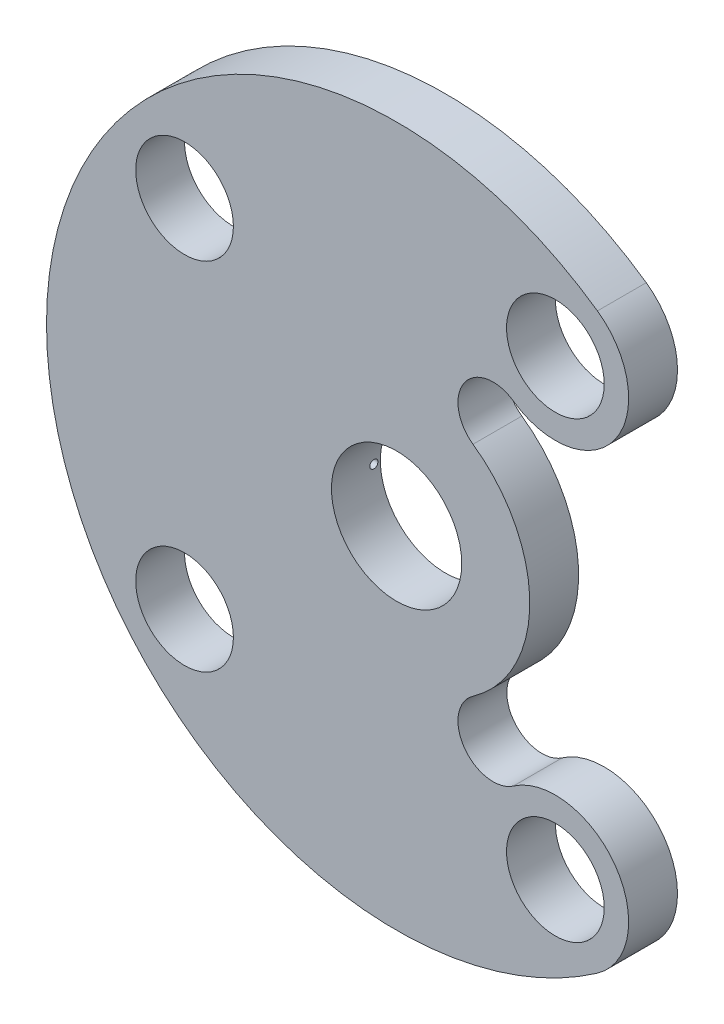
from build123d import *

# Parameters (mm, degrees)
ESQUISSE1_R             = 4
ESQUISSE1_R_2           = 3
EXTRUSION1_DEPTH        = 3
ENL_V_START             = -6.079454
ESQUISSE4_R             = 0.25
ENL_V_MAT_EXTRU_1_DEPTH = 2.087274


with BuildPart() as part:
    # Esquisse1 → Extrusion1 (new body)
    with BuildSketch(Plane.XY):
        with BuildLine():
            ThreePointArc((7.169705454, 10.239400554), (13.436983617, 11.344490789), (12.331893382, 17.611768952))
            ThreePointArc((12.331893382, 17.611768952), (-21.5, 0), (12.331893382, -17.611768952))
            ThreePointArc((12.331893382, -17.611768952), (13.436983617, -11.344490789), (7.169705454, -10.239400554))
            ThreePointArc((7.169705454, -10.239400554), (4.160561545, -9.708807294), (4.691154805, -6.699663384))
            ThreePointArc((4.691154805, -6.699663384), (8.178778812, 0), (4.691154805, 6.699663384))
            ThreePointArc((4.691154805, 6.699663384), (4.160561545, 9.708807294), (7.169705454, 10.239400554))
        make_face()
        Circle(ESQUISSE1_R, mode=Mode.SUBTRACT)
        with Locations((-13.022755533, -10.927389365)):
            Circle(ESQUISSE1_R_2, mode=Mode.SUBTRACT)
        with Locations((9.750799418, -13.925584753)):
            Circle(ESQUISSE1_R_2, mode=Mode.SUBTRACT)
        with Locations((-13.022755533, 10.927389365)):
            Circle(ESQUISSE1_R_2, mode=Mode.SUBTRACT)
        with Locations((9.750799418, 13.925584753)):
            Circle(ESQUISSE1_R_2, mode=Mode.SUBTRACT)
    extrude(amount=EXTRUSION1_DEPTH)

    # Esquisse3 → Enl_vement de mati_re-R_volution1 (revolve, cut)
    with BuildSketch(Plane(origin=(0, 0, 0), x_dir=(1, 0, 0), z_dir=(0, 1, 0))):
        Polygon((-13.90360047, 0.970440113), (-14.022755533, 0), (-6.119155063, -0.970440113), (-6, 0), align=None)
    revolve(axis=Axis((-24.2297912, 0, -2.238336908), (0.992546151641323, 0, 0.12186934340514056)), mode=Mode.SUBTRACT)

    # Esquisse4 → Enl_v. mat.-Extru.1 (cut)
    with BuildSketch(Plane(origin=(0, 0, 0), x_dir=(0, 0, -1), z_dir=(1, 0, 0)).offset(ENL_V_START)):
        with Locations((-0.397096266, 0)):
            Circle(ESQUISSE4_R)
    extrude(amount=ENL_V_MAT_EXTRU_1_DEPTH, mode=Mode.SUBTRACT)


solid = part.part
